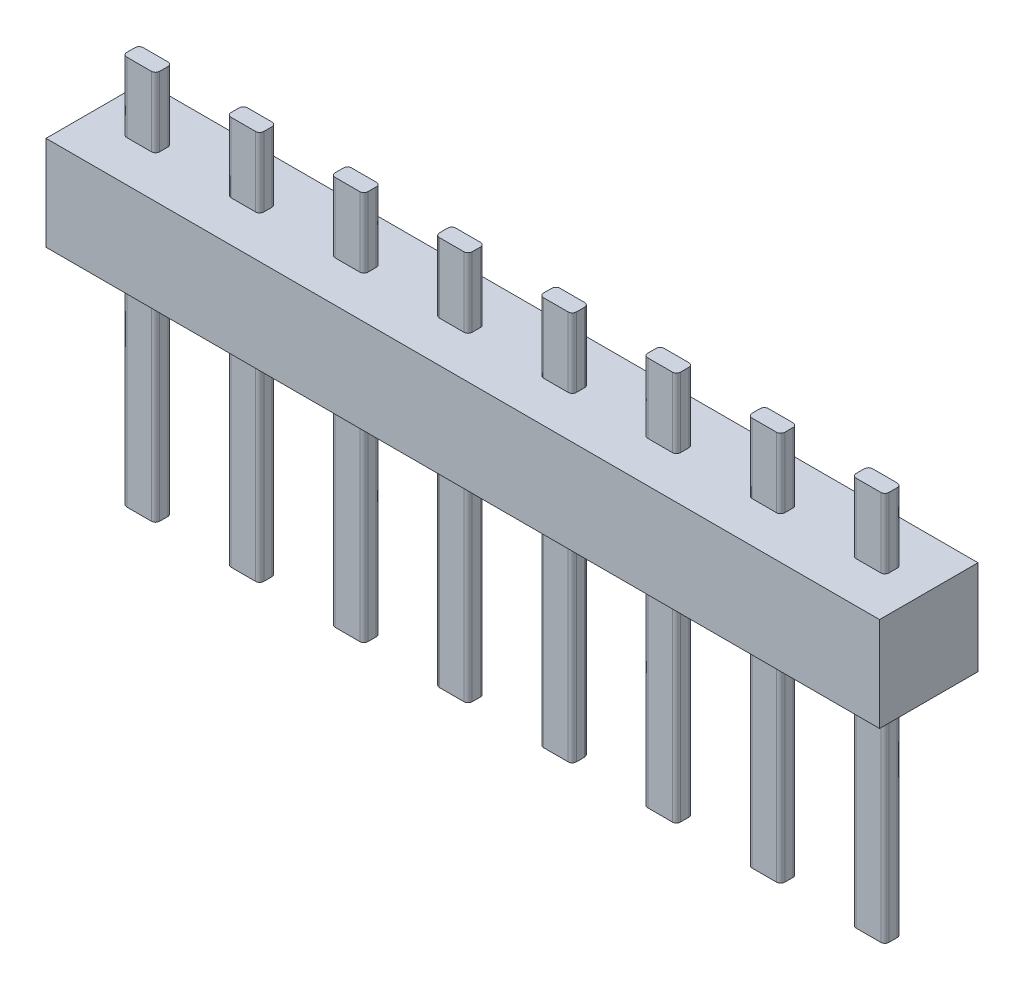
from build123d import *

# Parameters (mm, degrees)
ESQUISSE1_W           = 2.4
ESQUISSE1_H           = 2.3
EXTRUSION1_DEPTH      = 20.32
EXTRUSION2_DEPTH      = 5.5
EXTRUSION2_DEPTH_BACK = 4


with BuildPart() as part:
    # Esquisse1 → Extrusion1 (new body)
    with BuildSketch(Plane(origin=(0, 0, 0), x_dir=(0, 0, -1), z_dir=(1, 0, 0))):
        with Locations((1.2, 1.15)):
            Rectangle(ESQUISSE1_W, ESQUISSE1_H)
    extrude(amount=EXTRUSION1_DEPTH)

    # Esquisse3 → Extrusion2 (add, two sides: drawn at the far end of the back side and taken through both)
    with BuildSketch(Plane.XZ.offset(-EXTRUSION2_DEPTH_BACK)):
        with BuildLine():
            Line((19.35, -1), (18.75, -1))
            ThreePointArc((18.75, -1), (18.679289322, -1.029289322), (18.65, -1.1))
            Line((18.65, -1.1), (18.65, -1.3))
            ThreePointArc((18.65, -1.3), (18.679289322, -1.370710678), (18.75, -1.4))
            Line((18.75, -1.4), (19.35, -1.4))
            ThreePointArc((19.35, -1.4), (19.420710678, -1.370710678), (19.45, -1.3))
            Line((19.45, -1.3), (19.45, -1.1))
            ThreePointArc((19.45, -1.1), (19.420710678, -1.029289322), (19.35, -1))
        make_face()
        with BuildLine():
            Line((16.81, -1), (16.21, -1))
            ThreePointArc((16.21, -1), (16.139289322, -1.029289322), (16.11, -1.1))
            Line((16.11, -1.1), (16.11, -1.3))
            ThreePointArc((16.11, -1.3), (16.139289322, -1.370710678), (16.21, -1.4))
            Line((16.21, -1.4), (16.81, -1.4))
            ThreePointArc((16.81, -1.4), (16.880710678, -1.370710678), (16.91, -1.3))
            Line((16.91, -1.3), (16.91, -1.1))
            ThreePointArc((16.91, -1.1), (16.880710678, -1.029289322), (16.81, -1))
        make_face()
        with BuildLine():
            Line((14.27, -1), (13.67, -1))
            ThreePointArc((13.67, -1), (13.599289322, -1.029289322), (13.57, -1.1))
            Line((13.57, -1.1), (13.57, -1.3))
            ThreePointArc((13.57, -1.3), (13.599289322, -1.370710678), (13.67, -1.4))
            Line((13.67, -1.4), (14.27, -1.4))
            ThreePointArc((14.27, -1.4), (14.340710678, -1.370710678), (14.37, -1.3))
            Line((14.37, -1.3), (14.37, -1.1))
            ThreePointArc((14.37, -1.1), (14.340710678, -1.029289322), (14.27, -1))
        make_face()
        with BuildLine():
            Line((11.73, -1), (11.13, -1))
            ThreePointArc((11.13, -1), (11.059289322, -1.029289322), (11.03, -1.1))
            Line((11.03, -1.1), (11.03, -1.3))
            ThreePointArc((11.03, -1.3), (11.059289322, -1.370710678), (11.13, -1.4))
            Line((11.13, -1.4), (11.73, -1.4))
            ThreePointArc((11.73, -1.4), (11.800710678, -1.370710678), (11.83, -1.3))
            Line((11.83, -1.3), (11.83, -1.1))
            ThreePointArc((11.83, -1.1), (11.800710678, -1.029289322), (11.73, -1))
        make_face()
        with BuildLine():
            Line((9.19, -1), (8.59, -1))
            ThreePointArc((8.59, -1), (8.519289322, -1.029289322), (8.49, -1.1))
            Line((8.49, -1.1), (8.49, -1.3))
            ThreePointArc((8.49, -1.3), (8.519289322, -1.370710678), (8.59, -1.4))
            Line((8.59, -1.4), (9.19, -1.4))
            ThreePointArc((9.19, -1.4), (9.260710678, -1.370710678), (9.29, -1.3))
            Line((9.29, -1.3), (9.29, -1.1))
            ThreePointArc((9.29, -1.1), (9.260710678, -1.029289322), (9.19, -1))
        make_face()
        with BuildLine():
            Line((6.65, -1), (6.05, -1))
            ThreePointArc((6.05, -1), (5.979289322, -1.029289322), (5.95, -1.1))
            Line((5.95, -1.1), (5.95, -1.3))
            ThreePointArc((5.95, -1.3), (5.979289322, -1.370710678), (6.05, -1.4))
            Line((6.05, -1.4), (6.65, -1.4))
            ThreePointArc((6.65, -1.4), (6.720710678, -1.370710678), (6.75, -1.3))
            Line((6.75, -1.3), (6.75, -1.1))
            ThreePointArc((6.75, -1.1), (6.720710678, -1.029289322), (6.65, -1))
        make_face()
        with BuildLine():
            Line((4.11, -1), (3.51, -1))
            ThreePointArc((3.51, -1), (3.439289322, -1.029289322), (3.41, -1.1))
            Line((3.41, -1.1), (3.41, -1.3))
            ThreePointArc((3.41, -1.3), (3.439289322, -1.370710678), (3.51, -1.4))
            Line((3.51, -1.4), (4.11, -1.4))
            ThreePointArc((4.11, -1.4), (4.180710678, -1.370710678), (4.21, -1.3))
            Line((4.21, -1.3), (4.21, -1.1))
            ThreePointArc((4.21, -1.1), (4.180710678, -1.029289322), (4.11, -1))
        make_face()
        with BuildLine():
            Line((1.57, -1), (0.97, -1))
            ThreePointArc((0.97, -1), (0.899289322, -1.029289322), (0.87, -1.1))
            Line((0.87, -1.1), (0.87, -1.3))
            ThreePointArc((0.87, -1.3), (0.899289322, -1.370710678), (0.97, -1.4))
            Line((0.97, -1.4), (1.57, -1.4))
            ThreePointArc((1.57, -1.4), (1.640710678, -1.370710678), (1.67, -1.3))
            Line((1.67, -1.3), (1.67, -1.1))
            ThreePointArc((1.67, -1.1), (1.640710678, -1.029289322), (1.57, -1))
        make_face()
    extrude(amount=EXTRUSION2_DEPTH + EXTRUSION2_DEPTH_BACK)


solid = part.part
